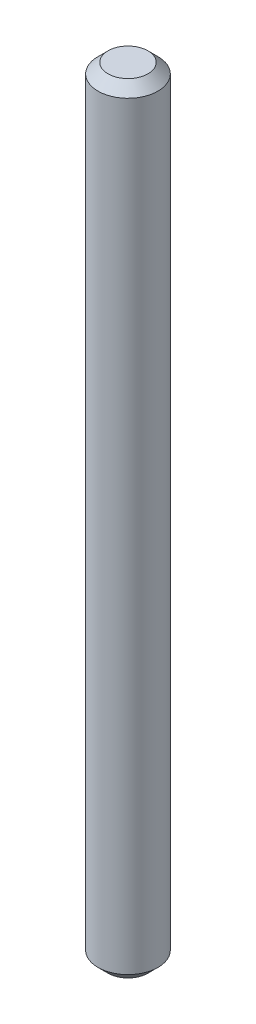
ISO-10303-21;
HEADER;
FILE_DESCRIPTION(('STEP AP214'),'2;1');
FILE_NAME('part.step','',(''),(''),'','','');
FILE_SCHEMA(('AUTOMOTIVE_DESIGN { 1 0 10303 214 1 1 1 1 }'));
ENDSEC;
DATA;
#1=APPLICATION_CONTEXT('core data for automotive mechanical design processes');
#2=APPLICATION_PROTOCOL_DEFINITION('international standard','automotive_design',2000,#1);
#3=PRODUCT_CONTEXT('',#1,'mechanical');
#4=PRODUCT('Part','Part','',(#3));
#5=PRODUCT_RELATED_PRODUCT_CATEGORY('part','',(#4));
#6=PRODUCT_DEFINITION_FORMATION('','',#4);
#7=PRODUCT_DEFINITION_CONTEXT('part definition',#1,'design');
#8=PRODUCT_DEFINITION('design','',#6,#7);
#9=PRODUCT_DEFINITION_SHAPE('','',#8);
#10=(LENGTH_UNIT() NAMED_UNIT(*) SI_UNIT(.MILLI.,.METRE.));
#11=(NAMED_UNIT(*) PLANE_ANGLE_UNIT() SI_UNIT($,.RADIAN.));
#12=(NAMED_UNIT(*) SI_UNIT($,.STERADIAN.) SOLID_ANGLE_UNIT());
#13=UNCERTAINTY_MEASURE_WITH_UNIT(LENGTH_MEASURE(1.E-05),#10,'distance_accuracy_value','');
#14=(GEOMETRIC_REPRESENTATION_CONTEXT(3) GLOBAL_UNCERTAINTY_ASSIGNED_CONTEXT((#13)) GLOBAL_UNIT_ASSIGNED_CONTEXT((#10,
#11,#12)) REPRESENTATION_CONTEXT('',''));
#15=CARTESIAN_POINT('',(0.,0.,0.));
#16=DIRECTION('',(0.,0.,1.));
#17=DIRECTION('',(1.,0.,0.));
#18=AXIS2_PLACEMENT_3D('',#15,#16,#17);
#19=CARTESIAN_POINT('',(0.,39.,0.));
#20=DIRECTION('',(0.,-1.,0.));
#21=DIRECTION('',(0.,0.,-1.));
#22=AXIS2_PLACEMENT_3D('',#19,#20,#21);
#23=CYLINDRICAL_SURFACE('',#22,3.);
#24=CARTESIAN_POINT('',(0.,-38.,0.));
#25=DIRECTION('',(0.,1.,0.));
#26=DIRECTION('',(0.,0.,1.));
#27=AXIS2_PLACEMENT_3D('',#24,#25,#26);
#28=CIRCLE('',#27,3.);
#29=CARTESIAN_POINT('',(0.,-38.,3.));
#30=VERTEX_POINT('',#29);
#31=EDGE_CURVE('E46',#30,#30,#28,.T.);
#32=ORIENTED_EDGE('',*,*,#31,.T.);
#33=EDGE_LOOP('',(#32));
#34=FACE_BOUND('',#33,.T.);
#35=CARTESIAN_POINT('',(0.,38.,0.));
#36=DIRECTION('',(0.,1.,0.));
#37=DIRECTION('',(0.,0.,1.));
#38=AXIS2_PLACEMENT_3D('',#35,#36,#37);
#39=CIRCLE('',#38,3.);
#40=CARTESIAN_POINT('',(0.,38.,3.));
#41=VERTEX_POINT('',#40);
#42=EDGE_CURVE('E51',#41,#41,#39,.F.);
#43=ORIENTED_EDGE('',*,*,#42,.T.);
#44=EDGE_LOOP('',(#43));
#45=FACE_BOUND('',#44,.T.);
#46=ADVANCED_FACE('F34',(#34,#45),#23,.T.);
#47=CARTESIAN_POINT('',(0.,39.,0.));
#48=DIRECTION('',(0.,1.,0.));
#49=DIRECTION('',(0.,0.,1.));
#50=AXIS2_PLACEMENT_3D('',#47,#48,#49);
#51=PLANE('',#50);
#52=CARTESIAN_POINT('',(0.,39.,0.));
#53=DIRECTION('',(0.,1.,0.));
#54=DIRECTION('',(0.,0.,1.));
#55=AXIS2_PLACEMENT_3D('',#52,#53,#54);
#56=CIRCLE('',#55,2.00000000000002);
#57=CARTESIAN_POINT('',(0.,39.,2.00000000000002));
#58=VERTEX_POINT('',#57);
#59=EDGE_CURVE('E10',#58,#58,#56,.T.);
#60=ORIENTED_EDGE('',*,*,#59,.T.);
#61=EDGE_LOOP('',(#60));
#62=FACE_BOUND('',#61,.T.);
#63=ADVANCED_FACE('F71',(#62),#51,.T.);
#64=CARTESIAN_POINT('',(0.,-39.,0.));
#65=DIRECTION('',(0.,1.,0.));
#66=DIRECTION('',(0.,0.,1.));
#67=AXIS2_PLACEMENT_3D('',#64,#65,#66);
#68=PLANE('',#67);
#69=CARTESIAN_POINT('',(0.,-39.,0.));
#70=DIRECTION('',(0.,1.,0.));
#71=DIRECTION('',(0.,0.,1.));
#72=AXIS2_PLACEMENT_3D('',#69,#70,#71);
#73=CIRCLE('',#72,1.99999999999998);
#74=CARTESIAN_POINT('',(0.,-39.,1.99999999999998));
#75=VERTEX_POINT('',#74);
#76=EDGE_CURVE('E41',#75,#75,#73,.F.);
#77=ORIENTED_EDGE('',*,*,#76,.T.);
#78=EDGE_LOOP('',(#77));
#79=FACE_BOUND('',#78,.T.);
#80=ADVANCED_FACE('F67',(#79),#68,.F.);
#81=CARTESIAN_POINT('',(0.,-38.,0.));
#82=DIRECTION('',(0.,1.,0.));
#83=DIRECTION('',(0.,0.,1.));
#84=AXIS2_PLACEMENT_3D('',#81,#82,#83);
#85=CONICAL_SURFACE('',#84,3.,0.785398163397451);
#86=ORIENTED_EDGE('',*,*,#76,.F.);
#87=EDGE_LOOP('',(#86));
#88=FACE_BOUND('',#87,.T.);
#89=ORIENTED_EDGE('',*,*,#31,.F.);
#90=EDGE_LOOP('',(#89));
#91=FACE_BOUND('',#90,.T.);
#92=ADVANCED_FACE('F62',(#88,#91),#85,.T.);
#93=CARTESIAN_POINT('',(0.,39.,0.));
#94=DIRECTION('',(0.,-1.,0.));
#95=DIRECTION('',(0.,0.,-1.));
#96=AXIS2_PLACEMENT_3D('',#93,#94,#95);
#97=CONICAL_SURFACE('',#96,2.00000000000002,0.785398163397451);
#98=ORIENTED_EDGE('',*,*,#42,.F.);
#99=EDGE_LOOP('',(#98));
#100=FACE_BOUND('',#99,.T.);
#101=ORIENTED_EDGE('',*,*,#59,.F.);
#102=EDGE_LOOP('',(#101));
#103=FACE_BOUND('',#102,.T.);
#104=ADVANCED_FACE('F59',(#100,#103),#97,.T.);
#105=CLOSED_SHELL('',(#46,#63,#80,#92,#104));
#106=MANIFOLD_SOLID_BREP('B2',#105);
#107=ADVANCED_BREP_SHAPE_REPRESENTATION('',(#18,#106),#14);
#108=SHAPE_DEFINITION_REPRESENTATION(#9,#107);
ENDSEC;
END-ISO-10303-21;
